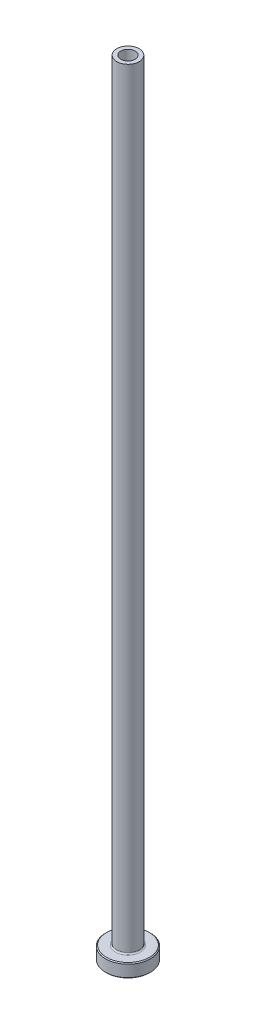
from build123d import *

# Parameters (mm, degrees)
FILLET1_R     = 0.3
CHAMFER1_SIZE = 0.2
CHAMFER3_SIZE = 0.5


with BuildPart() as part:
    # Sketch1 → Revolve1 (revolve)
    with BuildSketch(Plane.XY, mode=Mode.PRIVATE) as revolve1_sk:
        Polygon((-1.6, 175), (-2.5, 175), (-2.5, 3), (-5, 3), (-5, 0), (-1.85, 0), (-1.85, 118), (-1.6, 130), align=None)
    revolve(revolve1_sk.sketch.rotate(Axis((0, 92.187680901, 0), (0, -1, 0)), 270), axis=Axis((0, 92.187680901, 0), (0, -1, 0)))

    # Fillet1
    fillet1_edges = [part.edges().sort_by_distance(p)[0] for p in [
        (0, 3, -2.5),
    ]]
    fillet(fillet1_edges, radius=FILLET1_R)

    # Chamfer1
    chamfer1_edges = [part.edges().sort_by_distance(p)[0] for p in [
        (0, 0, -5),
        (0, 3, -5),
    ]]
    chamfer(chamfer1_edges, length=CHAMFER1_SIZE)

    # Chamfer3
    chamfer3_edges = [part.edges().sort_by_distance(p)[0] for p in [
        (0, 0, -1.85),
    ]]
    chamfer(chamfer3_edges, length=CHAMFER3_SIZE)


solid = part.part
